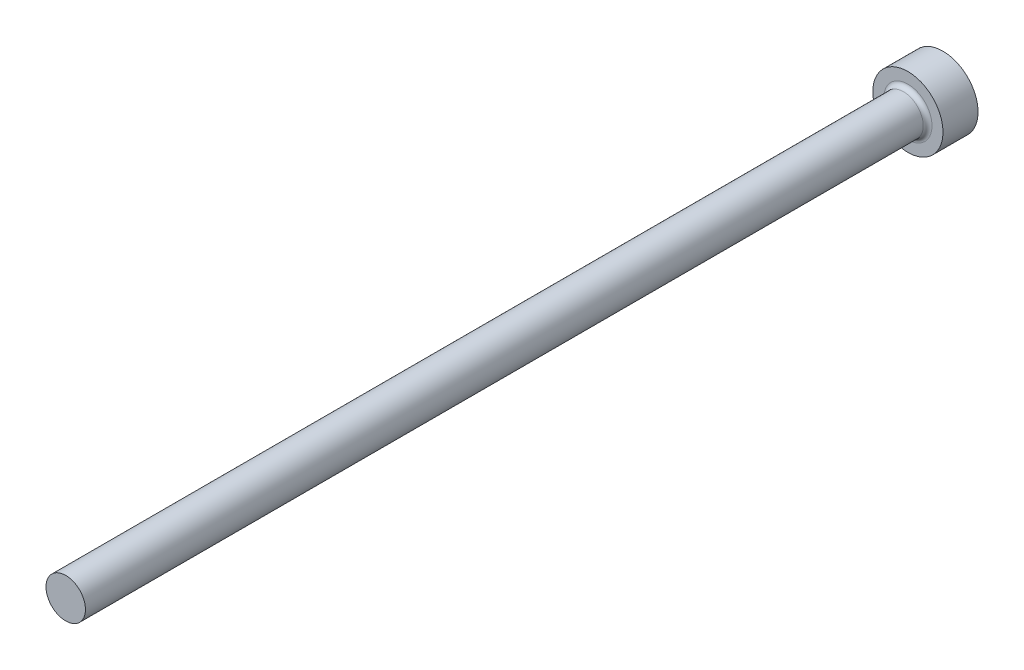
from build123d import *

# Parameters (mm, degrees)
FILLET1_R = 0.5


with BuildPart() as part:
    # FV → Revolve1 (revolve)
    with BuildSketch(Plane(origin=(0, 0, 0), x_dir=(1, 0, 0), z_dir=(0, 1, 0)), mode=Mode.PRIVATE) as revolve1_sk:
        Polygon((0, 0), (4, 0), (4, -4), (2.25, -4), (2.25, -100), (0, -100), align=None)
    revolve(revolve1_sk.sketch.rotate(Axis((0, 0, -9.033228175), (0, 0, 1)), 180), axis=Axis((0, 0, -9.033228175), (0, 0, 1)))

    # Fillet1
    fillet1_edges = [part.edges().sort_by_distance(p)[0] for p in [
        (2.25, 0, 4),
    ]]
    fillet(fillet1_edges, radius=FILLET1_R)


solid = part.part
